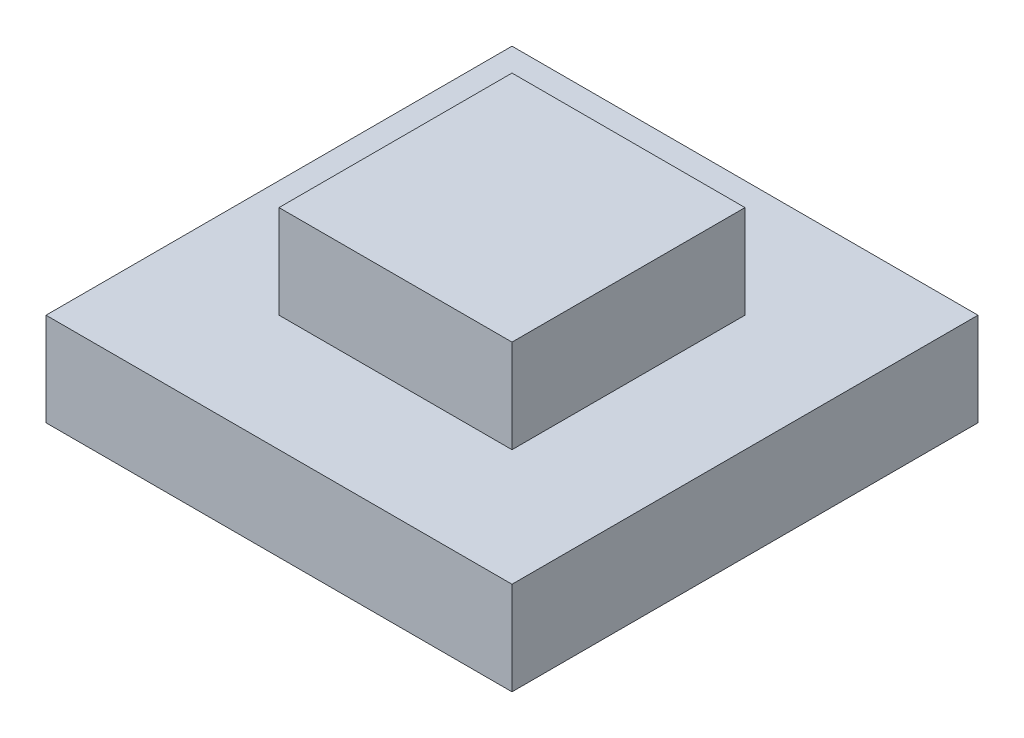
from build123d import *

# Parameters (mm, degrees)
SKETCH1_W           = 100
SKETCH1_H           = 100
BOSS_EXTRUDE1_DEPTH = 20
SKETCH2_W           = 50
SKETCH2_H           = 50
BOSS_EXTRUDE2_DEPTH = 20


with BuildPart() as part:
    # Sketch1 → Boss-Extrude1 (new body)
    with BuildSketch(Plane(origin=(0, 0, 0), x_dir=(1, 0, 0), z_dir=(0, 1, 0))):
        Rectangle(SKETCH1_W, SKETCH1_H)
    extrude(amount=BOSS_EXTRUDE1_DEPTH)


with BuildPart() as body_2:
    # Sketch2 → Boss-Extrude2 (new body)
    with BuildSketch(Plane(origin=(0, 20, 0), x_dir=(1, 0, 0), z_dir=(0, 1, 0))):
        Rectangle(SKETCH2_W, SKETCH2_H)
    extrude(amount=BOSS_EXTRUDE2_DEPTH)


solid = Compound([part.part, body_2.part])
